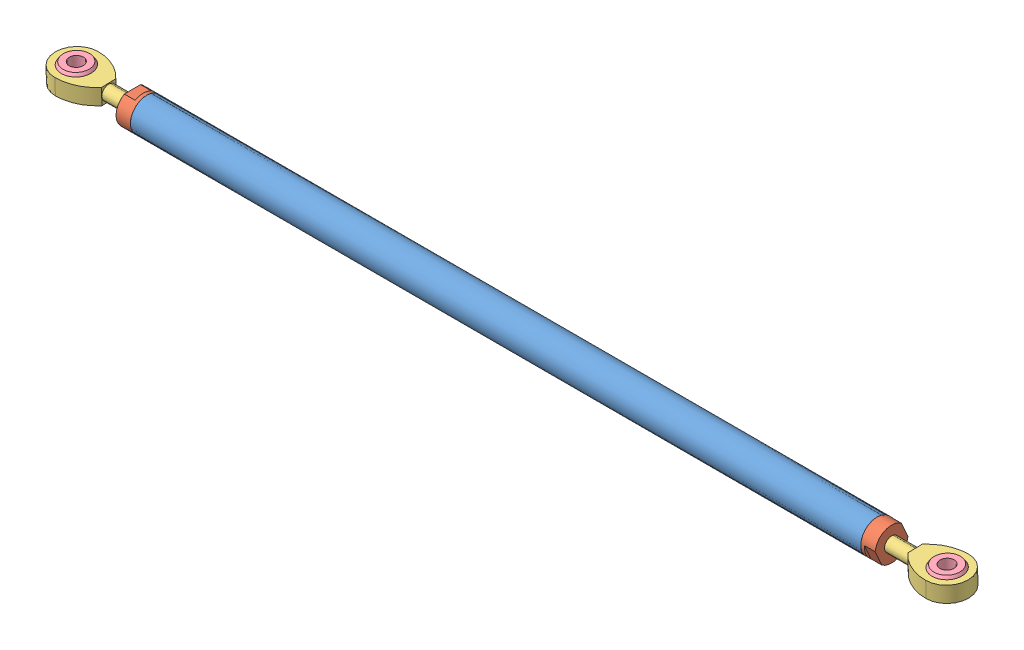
SolidWorks assembly Tie Rod Assembly.SLDASM, configuration Default (file format 5000). Lengths in mm.
Overall size (405.13 19.3 19.32).
9 component instances, 4 part files, 7 mates.
Components (placement in the parent):
- Tie Rod Tube - CF-1: Tie Rod Tube - CF.SLDPRT [Default] at origin size (323.85 14.58 14.58)
- Pull Rod Plug-1: Pull Rod Plug.SLDPRT [Default] at (-168.275 0 0) x (0 0 1) z (-1 0 0) size (14.61 14.61 35.88)
- Pull Rod Plug-2: Pull Rod Plug.SLDPRT [Default] at (168.275 0 0) x (0 -0.9126 -0.408853) z (1 0 0) size (14.61 14.61 35.88)
- Rod End Assembly-1: Rod End Assembly.SLDASM [Default] at (193.04 0 0) x (1 0 0) z (0 -0.028657 0.999589) size (49.23 9.53 19.05)
  - Rod End Outter-1: Rod End Outter.SLDPRT [Default] at origin size (49.23 7.14 19.05)
  - Spherical - Inner-1: Spherical - Inner.SLDPRT [Default] at origin size (15.06 9.53 15.06)
- Rod End Assembly-2: Rod End Assembly.SLDASM [Default] at (-193.04 0 0) x (-1 0 0) z (0 -0.028657 0.999589) size (49.23 9.53 19.05)
  - Rod End Outter-1: Rod End Outter.SLDPRT [Default] at origin size (49.23 7.14 19.05)
  - Spherical - Inner-1: Spherical - Inner.SLDPRT [Default] at origin size (15.06 9.53 15.06)
Mates (geometry in assembly coordinates):
- Concentric1: concentric anti-aligned: cylinder of Tie Rod Tube - CF-1 through (88.8575 0 0) axis (1 0 0) radius 6.35; cylinder of Pull Rod Plug-1 through (-136.525 0 0) axis (-1 0 0) radius 6.1468
- Coincident11: coincident anti-aligned: plane of Tie Rod Tube - CF-1 through (-161.925 7.2898 0) normal (-1 0 0); plane of Pull Rod Plug-1 through (-161.925 0 0) normal (1 0 0)
- Concentric2: concentric aligned: cylinder of Tie Rod Tube - CF-1 through (88.8575 0 0) axis (1 0 0) radius 6.35; cylinder of Pull Rod Plug-2 through (136.525 0 0) axis (1 0 0) radius 6.1468
- Coincident10: coincident anti-aligned: plane of Tie Rod Tube - CF-1 through (161.925 6.35 0) normal (1 0 0); plane of Pull Rod Plug-2 through (161.925 0 0) normal (-1 0 0)
- Concentric3: concentric aligned: cylinder of Tie Rod Tube - CF-1 through (88.8575 0 0) axis (1 0 0) radius 7.2898; cylinder of ? through (153.3398 0 0) axis (1 0 0) radius 3.175
- Concentric4: concentric anti-aligned: cylinder of Tie Rod Tube - CF-1 through (88.8575 0 0) axis (1 0 0) radius 7.2898; cylinder of ? through (-153.3398 0 0) axis (-1 0 0) radius 3.175
- Coincident8: coincident anti-aligned: plane of ? through (193.04 0 0) normal (0 0.999589 0.028657); plane of ?
